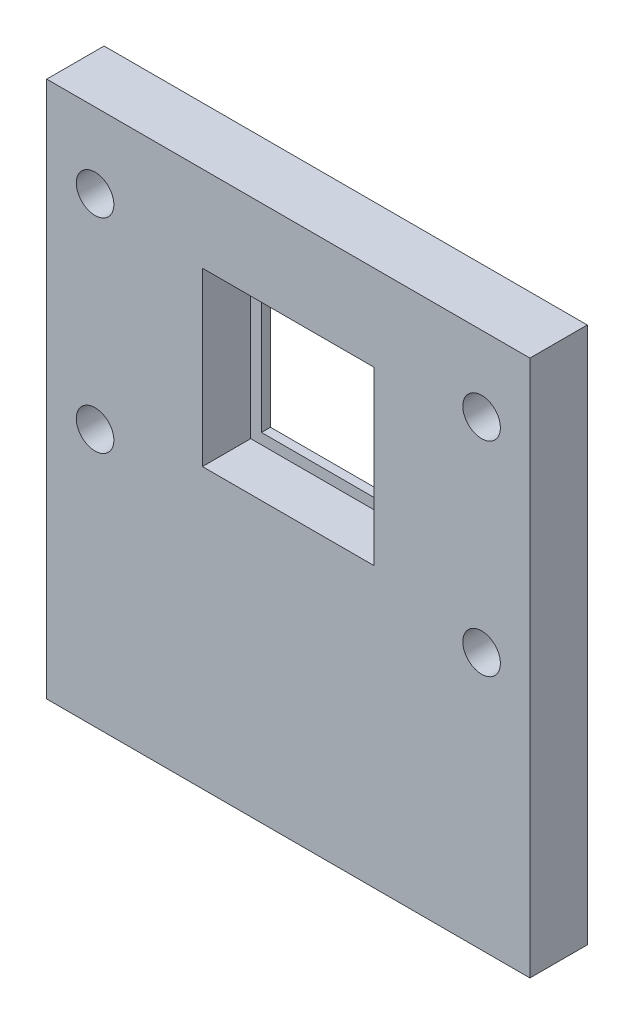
ISO-10303-21;
HEADER;
FILE_DESCRIPTION(('STEP AP214'),'2;1');
FILE_NAME('part.step','',(''),(''),'','','');
FILE_SCHEMA(('AUTOMOTIVE_DESIGN { 1 0 10303 214 1 1 1 1 }'));
ENDSEC;
DATA;
#1=APPLICATION_CONTEXT('core data for automotive mechanical design processes');
#2=APPLICATION_PROTOCOL_DEFINITION('international standard','automotive_design',2000,#1);
#3=PRODUCT_CONTEXT('',#1,'mechanical');
#4=PRODUCT('Part','Part','',(#3));
#5=PRODUCT_RELATED_PRODUCT_CATEGORY('part','',(#4));
#6=PRODUCT_DEFINITION_FORMATION('','',#4);
#7=PRODUCT_DEFINITION_CONTEXT('part definition',#1,'design');
#8=PRODUCT_DEFINITION('design','',#6,#7);
#9=PRODUCT_DEFINITION_SHAPE('','',#8);
#10=(LENGTH_UNIT() NAMED_UNIT(*) SI_UNIT(.MILLI.,.METRE.));
#11=(NAMED_UNIT(*) PLANE_ANGLE_UNIT() SI_UNIT($,.RADIAN.));
#12=(NAMED_UNIT(*) SI_UNIT($,.STERADIAN.) SOLID_ANGLE_UNIT());
#13=UNCERTAINTY_MEASURE_WITH_UNIT(LENGTH_MEASURE(1.E-05),#10,'distance_accuracy_value','');
#14=(GEOMETRIC_REPRESENTATION_CONTEXT(3) GLOBAL_UNCERTAINTY_ASSIGNED_CONTEXT((#13)) GLOBAL_UNIT_ASSIGNED_CONTEXT((#10,
#11,#12)) REPRESENTATION_CONTEXT('',''));
#15=CARTESIAN_POINT('',(0.,0.,0.));
#16=DIRECTION('',(0.,0.,1.));
#17=DIRECTION('',(1.,0.,0.));
#18=AXIS2_PLACEMENT_3D('',#15,#16,#17);
#19=CARTESIAN_POINT('',(-22.5,-25.,8.34));
#20=DIRECTION('',(1.,0.,0.));
#21=DIRECTION('',(0.,0.,-1.));
#22=AXIS2_PLACEMENT_3D('',#19,#20,#21);
#23=PLANE('',#22);
#24=DIRECTION('',(0.,1.,0.));
#25=VECTOR('',#24,1.);
#26=CARTESIAN_POINT('',(-22.5,-25.,3.));
#27=LINE('',#26,#25);
#28=CARTESIAN_POINT('',(-22.5,-25.,3.));
#29=VERTEX_POINT('',#28);
#30=CARTESIAN_POINT('',(-22.5,25.,3.));
#31=VERTEX_POINT('',#30);
#32=EDGE_CURVE('E187',#29,#31,#27,.T.);
#33=ORIENTED_EDGE('',*,*,#32,.F.);
#34=DIRECTION('',(0.,0.,-1.));
#35=VECTOR('',#34,1.);
#36=CARTESIAN_POINT('',(-22.5,-25.,8.34));
#37=LINE('',#36,#35);
#38=CARTESIAN_POINT('',(-22.5,-25.,8.34));
#39=VERTEX_POINT('',#38);
#40=EDGE_CURVE('E11',#39,#29,#37,.T.);
#41=ORIENTED_EDGE('',*,*,#40,.F.);
#42=DIRECTION('',(0.,-1.,0.));
#43=VECTOR('',#42,1.);
#44=CARTESIAN_POINT('',(-22.5,-25.,8.34));
#45=LINE('',#44,#43);
#46=CARTESIAN_POINT('',(-22.5,25.,8.34));
#47=VERTEX_POINT('',#46);
#48=EDGE_CURVE('E217',#47,#39,#45,.T.);
#49=ORIENTED_EDGE('',*,*,#48,.F.);
#50=DIRECTION('',(0.,0.,-1.));
#51=VECTOR('',#50,1.);
#52=CARTESIAN_POINT('',(-22.5,25.,8.34));
#53=LINE('',#52,#51);
#54=EDGE_CURVE('E232',#47,#31,#53,.T.);
#55=ORIENTED_EDGE('',*,*,#54,.T.);
#56=EDGE_LOOP('',(#33,#41,#49,#55));
#57=FACE_BOUND('',#56,.T.);
#58=ADVANCED_FACE('F35',(#57),#23,.F.);
#59=CARTESIAN_POINT('',(22.5,-25.,8.34));
#60=DIRECTION('',(0.,1.,0.));
#61=DIRECTION('',(-1.,0.,0.));
#62=AXIS2_PLACEMENT_3D('',#59,#60,#61);
#63=PLANE('',#62);
#64=DIRECTION('',(-1.,0.,0.));
#65=VECTOR('',#64,1.);
#66=CARTESIAN_POINT('',(-22.5,-25.,3.));
#67=LINE('',#66,#65);
#68=CARTESIAN_POINT('',(22.5,-25.,3.));
#69=VERTEX_POINT('',#68);
#70=EDGE_CURVE('E185',#69,#29,#67,.T.);
#71=ORIENTED_EDGE('',*,*,#70,.F.);
#72=DIRECTION('',(0.,0.,-1.));
#73=VECTOR('',#72,1.);
#74=CARTESIAN_POINT('',(22.5,-25.,8.34));
#75=LINE('',#74,#73);
#76=CARTESIAN_POINT('',(22.5,-25.,8.34));
#77=VERTEX_POINT('',#76);
#78=EDGE_CURVE('E42',#77,#69,#75,.T.);
#79=ORIENTED_EDGE('',*,*,#78,.F.);
#80=DIRECTION('',(1.,0.,0.));
#81=VECTOR('',#80,1.);
#82=CARTESIAN_POINT('',(22.5,-25.,8.34));
#83=LINE('',#82,#81);
#84=EDGE_CURVE('E226',#39,#77,#83,.T.);
#85=ORIENTED_EDGE('',*,*,#84,.F.);
#86=ORIENTED_EDGE('',*,*,#40,.T.);
#87=EDGE_LOOP('',(#71,#79,#85,#86));
#88=FACE_BOUND('',#87,.T.);
#89=ADVANCED_FACE('F246',(#88),#63,.F.);
#90=CARTESIAN_POINT('',(22.5,-25.,8.34));
#91=DIRECTION('',(-1.,0.,0.));
#92=DIRECTION('',(0.,0.,1.));
#93=AXIS2_PLACEMENT_3D('',#90,#91,#92);
#94=PLANE('',#93);
#95=DIRECTION('',(0.,-1.,0.));
#96=VECTOR('',#95,1.);
#97=CARTESIAN_POINT('',(22.5,-25.,3.));
#98=LINE('',#97,#96);
#99=CARTESIAN_POINT('',(22.5,25.,3.));
#100=VERTEX_POINT('',#99);
#101=EDGE_CURVE('E181',#100,#69,#98,.T.);
#102=ORIENTED_EDGE('',*,*,#101,.F.);
#103=DIRECTION('',(0.,0.,-1.));
#104=VECTOR('',#103,1.);
#105=CARTESIAN_POINT('',(22.5,25.,8.34));
#106=LINE('',#105,#104);
#107=CARTESIAN_POINT('',(22.5,25.,8.34));
#108=VERTEX_POINT('',#107);
#109=EDGE_CURVE('E235',#108,#100,#106,.T.);
#110=ORIENTED_EDGE('',*,*,#109,.F.);
#111=DIRECTION('',(0.,1.,0.));
#112=VECTOR('',#111,1.);
#113=CARTESIAN_POINT('',(22.5,-25.,8.34));
#114=LINE('',#113,#112);
#115=EDGE_CURVE('E228',#77,#108,#114,.T.);
#116=ORIENTED_EDGE('',*,*,#115,.F.);
#117=ORIENTED_EDGE('',*,*,#78,.T.);
#118=EDGE_LOOP('',(#102,#110,#116,#117));
#119=FACE_BOUND('',#118,.T.);
#120=ADVANCED_FACE('F242',(#119),#94,.F.);
#121=CARTESIAN_POINT('',(22.5,25.,8.34));
#122=DIRECTION('',(0.,-1.,0.));
#123=DIRECTION('',(1.,0.,0.));
#124=AXIS2_PLACEMENT_3D('',#121,#122,#123);
#125=PLANE('',#124);
#126=DIRECTION('',(1.,0.,0.));
#127=VECTOR('',#126,1.);
#128=CARTESIAN_POINT('',(-22.5,25.,3.));
#129=LINE('',#128,#127);
#130=EDGE_CURVE('E189',#31,#100,#129,.T.);
#131=ORIENTED_EDGE('',*,*,#130,.F.);
#132=ORIENTED_EDGE('',*,*,#54,.F.);
#133=DIRECTION('',(-1.,0.,0.));
#134=VECTOR('',#133,1.);
#135=CARTESIAN_POINT('',(22.5,25.,8.34));
#136=LINE('',#135,#134);
#137=EDGE_CURVE('E230',#108,#47,#136,.T.);
#138=ORIENTED_EDGE('',*,*,#137,.F.);
#139=ORIENTED_EDGE('',*,*,#109,.T.);
#140=EDGE_LOOP('',(#131,#132,#138,#139));
#141=FACE_BOUND('',#140,.T.);
#142=ADVANCED_FACE('F256',(#141),#125,.F.);
#143=CARTESIAN_POINT('',(0.,0.,8.34));
#144=DIRECTION('',(0.,0.,1.));
#145=DIRECTION('',(1.,0.,0.));
#146=AXIS2_PLACEMENT_3D('',#143,#144,#145);
#147=PLANE('',#146);
#148=CARTESIAN_POINT('',(18.,-1.,8.34));
#149=DIRECTION('',(0.,0.,1.));
#150=DIRECTION('',(1.,0.,0.));
#151=AXIS2_PLACEMENT_3D('',#148,#149,#150);
#152=CIRCLE('',#151,1.75);
#153=CARTESIAN_POINT('',(16.25,-1.,8.34));
#154=VERTEX_POINT('',#153);
#155=EDGE_CURVE('E156',#154,#154,#152,.F.);
#156=ORIENTED_EDGE('',*,*,#155,.T.);
#157=EDGE_LOOP('',(#156));
#158=FACE_BOUND('',#157,.T.);
#159=CARTESIAN_POINT('',(-18.,-1.,8.34));
#160=DIRECTION('',(0.,0.,1.));
#161=DIRECTION('',(1.,0.,0.));
#162=AXIS2_PLACEMENT_3D('',#159,#160,#161);
#163=CIRCLE('',#162,1.75);
#164=CARTESIAN_POINT('',(-19.75,-1.,8.34));
#165=VERTEX_POINT('',#164);
#166=EDGE_CURVE('E163',#165,#165,#163,.F.);
#167=ORIENTED_EDGE('',*,*,#166,.T.);
#168=EDGE_LOOP('',(#167));
#169=FACE_BOUND('',#168,.T.);
#170=CARTESIAN_POINT('',(-18.,18.,8.34));
#171=DIRECTION('',(0.,0.,1.));
#172=DIRECTION('',(1.,0.,0.));
#173=AXIS2_PLACEMENT_3D('',#170,#171,#172);
#174=CIRCLE('',#173,1.75);
#175=CARTESIAN_POINT('',(-19.75,18.,8.34));
#176=VERTEX_POINT('',#175);
#177=EDGE_CURVE('E169',#176,#176,#174,.F.);
#178=ORIENTED_EDGE('',*,*,#177,.T.);
#179=EDGE_LOOP('',(#178));
#180=FACE_BOUND('',#179,.T.);
#181=CARTESIAN_POINT('',(18.,18.,8.34));
#182=DIRECTION('',(0.,0.,1.));
#183=DIRECTION('',(1.,0.,0.));
#184=AXIS2_PLACEMENT_3D('',#181,#182,#183);
#185=CIRCLE('',#184,1.75);
#186=CARTESIAN_POINT('',(16.25,18.,8.34));
#187=VERTEX_POINT('',#186);
#188=EDGE_CURVE('E175',#187,#187,#185,.F.);
#189=ORIENTED_EDGE('',*,*,#188,.T.);
#190=EDGE_LOOP('',(#189));
#191=FACE_BOUND('',#190,.T.);
#192=DIRECTION('',(0.,1.,0.));
#193=VECTOR('',#192,1.);
#194=CARTESIAN_POINT('',(8.,1.,8.34));
#195=LINE('',#194,#193);
#196=CARTESIAN_POINT('',(8.,1.,8.34));
#197=VERTEX_POINT('',#196);
#198=CARTESIAN_POINT('',(8.,17.,8.34));
#199=VERTEX_POINT('',#198);
#200=EDGE_CURVE('E191',#197,#199,#195,.T.);
#201=ORIENTED_EDGE('',*,*,#200,.F.);
#202=DIRECTION('',(1.,0.,0.));
#203=VECTOR('',#202,1.);
#204=CARTESIAN_POINT('',(-8.,1.,8.34));
#205=LINE('',#204,#203);
#206=CARTESIAN_POINT('',(-8.,1.,8.34));
#207=VERTEX_POINT('',#206);
#208=EDGE_CURVE('E196',#207,#197,#205,.T.);
#209=ORIENTED_EDGE('',*,*,#208,.F.);
#210=DIRECTION('',(0.,-1.,0.));
#211=VECTOR('',#210,1.);
#212=CARTESIAN_POINT('',(-8.,1.,8.34));
#213=LINE('',#212,#211);
#214=CARTESIAN_POINT('',(-8.,17.,8.34));
#215=VERTEX_POINT('',#214);
#216=EDGE_CURVE('E210',#215,#207,#213,.T.);
#217=ORIENTED_EDGE('',*,*,#216,.F.);
#218=DIRECTION('',(-1.,0.,0.));
#219=VECTOR('',#218,1.);
#220=CARTESIAN_POINT('',(-8.,17.,8.34));
#221=LINE('',#220,#219);
#222=EDGE_CURVE('E207',#199,#215,#221,.T.);
#223=ORIENTED_EDGE('',*,*,#222,.F.);
#224=EDGE_LOOP('',(#201,#209,#217,#223));
#225=FACE_BOUND('',#224,.T.);
#226=ORIENTED_EDGE('',*,*,#48,.T.);
#227=ORIENTED_EDGE('',*,*,#84,.T.);
#228=ORIENTED_EDGE('',*,*,#115,.T.);
#229=ORIENTED_EDGE('',*,*,#137,.T.);
#230=EDGE_LOOP('',(#226,#227,#228,#229));
#231=FACE_BOUND('',#230,.T.);
#232=ADVANCED_FACE('F258',(#158,#169,#180,#191,#225,#231),#147,.T.);
#233=CARTESIAN_POINT('',(8.,1.,3.84));
#234=DIRECTION('',(1.,0.,0.));
#235=DIRECTION('',(0.,0.,-1.));
#236=AXIS2_PLACEMENT_3D('',#233,#234,#235);
#237=PLANE('',#236);
#238=ORIENTED_EDGE('',*,*,#200,.T.);
#239=DIRECTION('',(0.,0.,1.));
#240=VECTOR('',#239,1.);
#241=CARTESIAN_POINT('',(8.,17.,3.84));
#242=LINE('',#241,#240);
#243=CARTESIAN_POINT('',(8.,17.,3.84));
#244=VERTEX_POINT('',#243);
#245=EDGE_CURVE('E205',#244,#199,#242,.T.);
#246=ORIENTED_EDGE('',*,*,#245,.F.);
#247=DIRECTION('',(0.,1.,0.));
#248=VECTOR('',#247,1.);
#249=CARTESIAN_POINT('',(8.,1.,3.84));
#250=LINE('',#249,#248);
#251=CARTESIAN_POINT('',(8.,1.,3.84));
#252=VERTEX_POINT('',#251);
#253=EDGE_CURVE('E192',#252,#244,#250,.T.);
#254=ORIENTED_EDGE('',*,*,#253,.F.);
#255=DIRECTION('',(0.,0.,1.));
#256=VECTOR('',#255,1.);
#257=CARTESIAN_POINT('',(8.,1.,3.84));
#258=LINE('',#257,#256);
#259=EDGE_CURVE('E215',#252,#197,#258,.T.);
#260=ORIENTED_EDGE('',*,*,#259,.T.);
#261=EDGE_LOOP('',(#238,#246,#254,#260));
#262=FACE_BOUND('',#261,.T.);
#263=ADVANCED_FACE('F260',(#262),#237,.F.);
#264=CARTESIAN_POINT('',(-8.,1.,3.84));
#265=DIRECTION('',(0.,-1.,0.));
#266=DIRECTION('',(0.,0.,-1.));
#267=AXIS2_PLACEMENT_3D('',#264,#265,#266);
#268=PLANE('',#267);
#269=ORIENTED_EDGE('',*,*,#208,.T.);
#270=ORIENTED_EDGE('',*,*,#259,.F.);
#271=DIRECTION('',(1.,0.,0.));
#272=VECTOR('',#271,1.);
#273=CARTESIAN_POINT('',(-8.,1.,3.84));
#274=LINE('',#273,#272);
#275=CARTESIAN_POINT('',(-8.,1.,3.84));
#276=VERTEX_POINT('',#275);
#277=EDGE_CURVE('E202',#276,#252,#274,.T.);
#278=ORIENTED_EDGE('',*,*,#277,.F.);
#279=DIRECTION('',(0.,0.,1.));
#280=VECTOR('',#279,1.);
#281=CARTESIAN_POINT('',(-8.,1.,3.84));
#282=LINE('',#281,#280);
#283=EDGE_CURVE('E218',#276,#207,#282,.T.);
#284=ORIENTED_EDGE('',*,*,#283,.T.);
#285=EDGE_LOOP('',(#269,#270,#278,#284));
#286=FACE_BOUND('',#285,.T.);
#287=ADVANCED_FACE('F267',(#286),#268,.F.);
#288=CARTESIAN_POINT('',(-8.,1.,3.84));
#289=DIRECTION('',(-1.,0.,0.));
#290=DIRECTION('',(0.,-1.,0.));
#291=AXIS2_PLACEMENT_3D('',#288,#289,#290);
#292=PLANE('',#291);
#293=ORIENTED_EDGE('',*,*,#216,.T.);
#294=ORIENTED_EDGE('',*,*,#283,.F.);
#295=DIRECTION('',(0.,-1.,0.));
#296=VECTOR('',#295,1.);
#297=CARTESIAN_POINT('',(-8.,1.,3.84));
#298=LINE('',#297,#296);
#299=CARTESIAN_POINT('',(-8.,17.,3.84));
#300=VERTEX_POINT('',#299);
#301=EDGE_CURVE('E199',#300,#276,#298,.T.);
#302=ORIENTED_EDGE('',*,*,#301,.F.);
#303=DIRECTION('',(0.,0.,1.));
#304=VECTOR('',#303,1.);
#305=CARTESIAN_POINT('',(-8.,17.,3.84));
#306=LINE('',#305,#304);
#307=EDGE_CURVE('E220',#300,#215,#306,.T.);
#308=ORIENTED_EDGE('',*,*,#307,.T.);
#309=EDGE_LOOP('',(#293,#294,#302,#308));
#310=FACE_BOUND('',#309,.T.);
#311=ADVANCED_FACE('F395',(#310),#292,.F.);
#312=CARTESIAN_POINT('',(-8.,17.,3.84));
#313=DIRECTION('',(0.,1.,0.));
#314=DIRECTION('',(-1.,0.,0.));
#315=AXIS2_PLACEMENT_3D('',#312,#313,#314);
#316=PLANE('',#315);
#317=ORIENTED_EDGE('',*,*,#222,.T.);
#318=ORIENTED_EDGE('',*,*,#307,.F.);
#319=DIRECTION('',(-1.,0.,0.));
#320=VECTOR('',#319,1.);
#321=CARTESIAN_POINT('',(-8.,17.,3.84));
#322=LINE('',#321,#320);
#323=EDGE_CURVE('E195',#244,#300,#322,.T.);
#324=ORIENTED_EDGE('',*,*,#323,.F.);
#325=ORIENTED_EDGE('',*,*,#245,.T.);
#326=EDGE_LOOP('',(#317,#318,#324,#325));
#327=FACE_BOUND('',#326,.T.);
#328=ADVANCED_FACE('F345',(#327),#316,.F.);
#329=CARTESIAN_POINT('',(0.,0.,3.84));
#330=DIRECTION('',(0.,0.,-1.));
#331=DIRECTION('',(-1.,0.,0.));
#332=AXIS2_PLACEMENT_3D('',#329,#330,#331);
#333=PLANE('',#332);
#334=DIRECTION('',(1.,0.,0.));
#335=VECTOR('',#334,1.);
#336=CARTESIAN_POINT('',(-7.,2.,3.84));
#337=LINE('',#336,#335);
#338=CARTESIAN_POINT('',(-7.,2.,3.84));
#339=VERTEX_POINT('',#338);
#340=CARTESIAN_POINT('',(7.,2.,3.84));
#341=VERTEX_POINT('',#340);
#342=EDGE_CURVE('E150',#339,#341,#337,.T.);
#343=ORIENTED_EDGE('',*,*,#342,.F.);
#344=DIRECTION('',(0.,-1.,0.));
#345=VECTOR('',#344,1.);
#346=CARTESIAN_POINT('',(-7.,16.,3.84));
#347=LINE('',#346,#345);
#348=CARTESIAN_POINT('',(-7.,16.,3.84));
#349=VERTEX_POINT('',#348);
#350=EDGE_CURVE('E49',#349,#339,#347,.T.);
#351=ORIENTED_EDGE('',*,*,#350,.F.);
#352=DIRECTION('',(-1.,0.,0.));
#353=VECTOR('',#352,1.);
#354=CARTESIAN_POINT('',(-7.,16.,3.84));
#355=LINE('',#354,#353);
#356=CARTESIAN_POINT('',(7.,16.,3.84));
#357=VERTEX_POINT('',#356);
#358=EDGE_CURVE('E141',#357,#349,#355,.T.);
#359=ORIENTED_EDGE('',*,*,#358,.F.);
#360=DIRECTION('',(0.,1.,0.));
#361=VECTOR('',#360,1.);
#362=CARTESIAN_POINT('',(7.,16.,3.84));
#363=LINE('',#362,#361);
#364=EDGE_CURVE('E144',#341,#357,#363,.T.);
#365=ORIENTED_EDGE('',*,*,#364,.F.);
#366=EDGE_LOOP('',(#343,#351,#359,#365));
#367=FACE_BOUND('',#366,.T.);
#368=ORIENTED_EDGE('',*,*,#253,.T.);
#369=ORIENTED_EDGE('',*,*,#323,.T.);
#370=ORIENTED_EDGE('',*,*,#301,.T.);
#371=ORIENTED_EDGE('',*,*,#277,.T.);
#372=EDGE_LOOP('',(#368,#369,#370,#371));
#373=FACE_BOUND('',#372,.T.);
#374=ADVANCED_FACE('F341',(#367,#373),#333,.F.);
#375=CARTESIAN_POINT('',(0.,0.,3.));
#376=DIRECTION('',(0.,0.,-1.));
#377=DIRECTION('',(-1.,0.,0.));
#378=AXIS2_PLACEMENT_3D('',#375,#376,#377);
#379=PLANE('',#378);
#380=DIRECTION('',(0.,-1.,0.));
#381=VECTOR('',#380,1.);
#382=CARTESIAN_POINT('',(-7.,16.,3.));
#383=LINE('',#382,#381);
#384=CARTESIAN_POINT('',(-7.,16.,3.));
#385=VERTEX_POINT('',#384);
#386=CARTESIAN_POINT('',(-7.,2.,3.));
#387=VERTEX_POINT('',#386);
#388=EDGE_CURVE('E125',#385,#387,#383,.T.);
#389=ORIENTED_EDGE('',*,*,#388,.T.);
#390=DIRECTION('',(1.,0.,0.));
#391=VECTOR('',#390,1.);
#392=CARTESIAN_POINT('',(-7.,2.,3.));
#393=LINE('',#392,#391);
#394=CARTESIAN_POINT('',(7.,2.,3.));
#395=VERTEX_POINT('',#394);
#396=EDGE_CURVE('E134',#387,#395,#393,.T.);
#397=ORIENTED_EDGE('',*,*,#396,.T.);
#398=DIRECTION('',(0.,1.,0.));
#399=VECTOR('',#398,1.);
#400=CARTESIAN_POINT('',(7.,16.,3.));
#401=LINE('',#400,#399);
#402=CARTESIAN_POINT('',(7.,16.,3.));
#403=VERTEX_POINT('',#402);
#404=EDGE_CURVE('E57',#395,#403,#401,.T.);
#405=ORIENTED_EDGE('',*,*,#404,.T.);
#406=DIRECTION('',(-1.,0.,0.));
#407=VECTOR('',#406,1.);
#408=CARTESIAN_POINT('',(-7.,16.,3.));
#409=LINE('',#408,#407);
#410=EDGE_CURVE('E131',#403,#385,#409,.T.);
#411=ORIENTED_EDGE('',*,*,#410,.T.);
#412=EDGE_LOOP('',(#389,#397,#405,#411));
#413=FACE_BOUND('',#412,.T.);
#414=CARTESIAN_POINT('',(18.,-1.,3.));
#415=DIRECTION('',(0.,0.,-1.));
#416=DIRECTION('',(-1.,0.,0.));
#417=AXIS2_PLACEMENT_3D('',#414,#415,#416);
#418=CIRCLE('',#417,1.75);
#419=CARTESIAN_POINT('',(16.25,-1.,3.));
#420=VERTEX_POINT('',#419);
#421=EDGE_CURVE('E160',#420,#420,#418,.T.);
#422=ORIENTED_EDGE('',*,*,#421,.F.);
#423=EDGE_LOOP('',(#422));
#424=FACE_BOUND('',#423,.T.);
#425=CARTESIAN_POINT('',(-18.,-1.,3.));
#426=DIRECTION('',(0.,0.,-1.));
#427=DIRECTION('',(-1.,0.,0.));
#428=AXIS2_PLACEMENT_3D('',#425,#426,#427);
#429=CIRCLE('',#428,1.75);
#430=CARTESIAN_POINT('',(-19.75,-1.,3.));
#431=VERTEX_POINT('',#430);
#432=EDGE_CURVE('E166',#431,#431,#429,.T.);
#433=ORIENTED_EDGE('',*,*,#432,.F.);
#434=EDGE_LOOP('',(#433));
#435=FACE_BOUND('',#434,.T.);
#436=CARTESIAN_POINT('',(-18.,18.,3.));
#437=DIRECTION('',(0.,0.,-1.));
#438=DIRECTION('',(-1.,0.,0.));
#439=AXIS2_PLACEMENT_3D('',#436,#437,#438);
#440=CIRCLE('',#439,1.75);
#441=CARTESIAN_POINT('',(-19.75,18.,3.));
#442=VERTEX_POINT('',#441);
#443=EDGE_CURVE('E172',#442,#442,#440,.T.);
#444=ORIENTED_EDGE('',*,*,#443,.F.);
#445=EDGE_LOOP('',(#444));
#446=FACE_BOUND('',#445,.T.);
#447=CARTESIAN_POINT('',(18.,18.,3.));
#448=DIRECTION('',(0.,0.,-1.));
#449=DIRECTION('',(-1.,0.,0.));
#450=AXIS2_PLACEMENT_3D('',#447,#448,#449);
#451=CIRCLE('',#450,1.75);
#452=CARTESIAN_POINT('',(16.25,18.,3.));
#453=VERTEX_POINT('',#452);
#454=EDGE_CURVE('E178',#453,#453,#451,.T.);
#455=ORIENTED_EDGE('',*,*,#454,.F.);
#456=EDGE_LOOP('',(#455));
#457=FACE_BOUND('',#456,.T.);
#458=ORIENTED_EDGE('',*,*,#101,.T.);
#459=ORIENTED_EDGE('',*,*,#70,.T.);
#460=ORIENTED_EDGE('',*,*,#32,.T.);
#461=ORIENTED_EDGE('',*,*,#130,.T.);
#462=EDGE_LOOP('',(#458,#459,#460,#461));
#463=FACE_BOUND('',#462,.T.);
#464=ADVANCED_FACE('F138',(#413,#424,#435,#446,#457,#463),#379,.T.);
#465=CARTESIAN_POINT('',(18.,18.,8.341));
#466=DIRECTION('',(0.,0.,-1.));
#467=DIRECTION('',(-1.,0.,0.));
#468=AXIS2_PLACEMENT_3D('',#465,#466,#467);
#469=CYLINDRICAL_SURFACE('',#468,1.75);
#470=CARTESIAN_POINT('',(16.25,18.,8.34));
#471=CARTESIAN_POINT('',(16.25,18.,8.284375));
#472=CARTESIAN_POINT('',(16.25,18.,8.22875));
#473=CARTESIAN_POINT('',(16.25,18.,8.1175));
#474=CARTESIAN_POINT('',(16.25,18.,8.061875));
#475=CARTESIAN_POINT('',(16.25,18.,7.950625));
#476=CARTESIAN_POINT('',(16.25,18.,7.895));
#477=CARTESIAN_POINT('',(16.25,18.,7.78375));
#478=CARTESIAN_POINT('',(16.25,18.,7.728125));
#479=CARTESIAN_POINT('',(16.25,18.,7.616875));
#480=CARTESIAN_POINT('',(16.25,18.,7.56125));
#481=CARTESIAN_POINT('',(16.25,18.,7.45));
#482=CARTESIAN_POINT('',(16.25,18.,7.394375));
#483=CARTESIAN_POINT('',(16.25,18.,7.283125));
#484=CARTESIAN_POINT('',(16.25,18.,7.2275));
#485=CARTESIAN_POINT('',(16.25,18.,7.11625));
#486=CARTESIAN_POINT('',(16.25,18.,7.060625));
#487=CARTESIAN_POINT('',(16.25,18.,6.949375));
#488=CARTESIAN_POINT('',(16.25,18.,6.89375));
#489=CARTESIAN_POINT('',(16.25,18.,6.7825));
#490=CARTESIAN_POINT('',(16.25,18.,6.726875));
#491=CARTESIAN_POINT('',(16.25,18.,6.615625));
#492=CARTESIAN_POINT('',(16.25,18.,6.56));
#493=CARTESIAN_POINT('',(16.25,18.,6.44875));
#494=CARTESIAN_POINT('',(16.25,18.,6.393125));
#495=CARTESIAN_POINT('',(16.25,18.,6.281875));
#496=CARTESIAN_POINT('',(16.25,18.,6.22625));
#497=CARTESIAN_POINT('',(16.25,18.,6.115));
#498=CARTESIAN_POINT('',(16.25,18.,6.059375));
#499=CARTESIAN_POINT('',(16.25,18.,5.948125));
#500=CARTESIAN_POINT('',(16.25,18.,5.8925));
#501=CARTESIAN_POINT('',(16.25,18.,5.78125));
#502=CARTESIAN_POINT('',(16.25,18.,5.725625));
#503=CARTESIAN_POINT('',(16.25,18.,5.614375));
#504=CARTESIAN_POINT('',(16.25,18.,5.55875));
#505=CARTESIAN_POINT('',(16.25,18.,5.4475));
#506=CARTESIAN_POINT('',(16.25,18.,5.391875));
#507=CARTESIAN_POINT('',(16.25,18.,5.280625));
#508=CARTESIAN_POINT('',(16.25,18.,5.225));
#509=CARTESIAN_POINT('',(16.25,18.,5.11375));
#510=CARTESIAN_POINT('',(16.25,18.,5.058125));
#511=CARTESIAN_POINT('',(16.25,18.,4.946875));
#512=CARTESIAN_POINT('',(16.25,18.,4.89125));
#513=CARTESIAN_POINT('',(16.25,18.,4.78));
#514=CARTESIAN_POINT('',(16.25,18.,4.724375));
#515=CARTESIAN_POINT('',(16.25,18.,4.613125));
#516=CARTESIAN_POINT('',(16.25,18.,4.5575));
#517=CARTESIAN_POINT('',(16.25,18.,4.44625));
#518=CARTESIAN_POINT('',(16.25,18.,4.390625));
#519=CARTESIAN_POINT('',(16.25,18.,4.279375));
#520=CARTESIAN_POINT('',(16.25,18.,4.22375));
#521=CARTESIAN_POINT('',(16.25,18.,4.1125));
#522=CARTESIAN_POINT('',(16.25,18.,4.056875));
#523=CARTESIAN_POINT('',(16.25,18.,3.945625));
#524=CARTESIAN_POINT('',(16.25,18.,3.89));
#525=CARTESIAN_POINT('',(16.25,18.,3.77875));
#526=CARTESIAN_POINT('',(16.25,18.,3.723125));
#527=CARTESIAN_POINT('',(16.25,18.,3.611875));
#528=CARTESIAN_POINT('',(16.25,18.,3.55625));
#529=CARTESIAN_POINT('',(16.25,18.,3.445));
#530=CARTESIAN_POINT('',(16.25,18.,3.389375));
#531=CARTESIAN_POINT('',(16.25,18.,3.278125));
#532=CARTESIAN_POINT('',(16.25,18.,3.2225));
#533=CARTESIAN_POINT('',(16.25,18.,3.11125));
#534=CARTESIAN_POINT('',(16.25,18.,3.055625));
#535=CARTESIAN_POINT('',(16.25,18.,3.));
#536=B_SPLINE_CURVE_WITH_KNOTS('',3,(#470,#471,#472,#473,#474,#475,#476,#477,#478,#479,#480,
#481,#482,#483,#484,#485,#486,#487,#488,#489,#490,#491,#492,#493,#494,#495,#496,#497,#498,#499,
#500,#501,#502,#503,#504,#505,#506,#507,#508,#509,#510,#511,#512,#513,#514,#515,#516,#517,#518,
#519,#520,#521,#522,#523,#524,#525,#526,#527,#528,#529,#530,#531,#532,#533,#534,#535),
.UNSPECIFIED.,.F.,.F.,(4,2,2,2,2,2,2,2,2,2,2,2,2,2,2,2,2,2,2,2,2,2,2,2,2,2,2,2,2,2,2,2,4),(0.,
0.166874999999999,0.333749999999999,0.500624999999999,0.667499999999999,0.834374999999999,
1.00125,1.168125,1.335,1.501875,1.66875,1.835625,2.0025,2.169375,2.33625,2.503125,2.67,2.836875,
3.00375,3.170625,3.3375,3.504375,3.67125,3.838125,4.005,4.171875,4.33875,4.505625,4.6725,
4.839375,5.00625,5.173125,5.34),.UNSPECIFIED.);
#537=EDGE_CURVE('BSEAM297',#187,#453,#536,.T.);
#538=ORIENTED_EDGE('',*,*,#188,.F.);
#539=ORIENTED_EDGE('',*,*,#454,.T.);
#540=ORIENTED_EDGE('',*,*,#537,.T.);
#541=ORIENTED_EDGE('',*,*,#537,.F.);
#542=EDGE_LOOP('',(#538,#540,#539,#541));
#543=FACE_BOUND('',#542,.T.);
#544=ADVANCED_FACE('F297',(#543),#469,.F.);
#545=CARTESIAN_POINT('',(-18.,18.,8.341));
#546=DIRECTION('',(0.,0.,-1.));
#547=DIRECTION('',(-1.,0.,0.));
#548=AXIS2_PLACEMENT_3D('',#545,#546,#547);
#549=CYLINDRICAL_SURFACE('',#548,1.75);
#550=CARTESIAN_POINT('',(-19.75,18.,8.34));
#551=CARTESIAN_POINT('',(-19.75,18.,8.284375));
#552=CARTESIAN_POINT('',(-19.75,18.,8.22875));
#553=CARTESIAN_POINT('',(-19.75,18.,8.1175));
#554=CARTESIAN_POINT('',(-19.75,18.,8.061875));
#555=CARTESIAN_POINT('',(-19.75,18.,7.950625));
#556=CARTESIAN_POINT('',(-19.75,18.,7.895));
#557=CARTESIAN_POINT('',(-19.75,18.,7.78375));
#558=CARTESIAN_POINT('',(-19.75,18.,7.728125));
#559=CARTESIAN_POINT('',(-19.75,18.,7.616875));
#560=CARTESIAN_POINT('',(-19.75,18.,7.56125));
#561=CARTESIAN_POINT('',(-19.75,18.,7.45));
#562=CARTESIAN_POINT('',(-19.75,18.,7.394375));
#563=CARTESIAN_POINT('',(-19.75,18.,7.283125));
#564=CARTESIAN_POINT('',(-19.75,18.,7.2275));
#565=CARTESIAN_POINT('',(-19.75,18.,7.11625));
#566=CARTESIAN_POINT('',(-19.75,18.,7.060625));
#567=CARTESIAN_POINT('',(-19.75,18.,6.949375));
#568=CARTESIAN_POINT('',(-19.75,18.,6.89375));
#569=CARTESIAN_POINT('',(-19.75,18.,6.7825));
#570=CARTESIAN_POINT('',(-19.75,18.,6.726875));
#571=CARTESIAN_POINT('',(-19.75,18.,6.615625));
#572=CARTESIAN_POINT('',(-19.75,18.,6.56));
#573=CARTESIAN_POINT('',(-19.75,18.,6.44875));
#574=CARTESIAN_POINT('',(-19.75,18.,6.393125));
#575=CARTESIAN_POINT('',(-19.75,18.,6.281875));
#576=CARTESIAN_POINT('',(-19.75,18.,6.22625));
#577=CARTESIAN_POINT('',(-19.75,18.,6.115));
#578=CARTESIAN_POINT('',(-19.75,18.,6.059375));
#579=CARTESIAN_POINT('',(-19.75,18.,5.948125));
#580=CARTESIAN_POINT('',(-19.75,18.,5.8925));
#581=CARTESIAN_POINT('',(-19.75,18.,5.78125));
#582=CARTESIAN_POINT('',(-19.75,18.,5.725625));
#583=CARTESIAN_POINT('',(-19.75,18.,5.614375));
#584=CARTESIAN_POINT('',(-19.75,18.,5.55875));
#585=CARTESIAN_POINT('',(-19.75,18.,5.4475));
#586=CARTESIAN_POINT('',(-19.75,18.,5.391875));
#587=CARTESIAN_POINT('',(-19.75,18.,5.280625));
#588=CARTESIAN_POINT('',(-19.75,18.,5.225));
#589=CARTESIAN_POINT('',(-19.75,18.,5.11375));
#590=CARTESIAN_POINT('',(-19.75,18.,5.058125));
#591=CARTESIAN_POINT('',(-19.75,18.,4.946875));
#592=CARTESIAN_POINT('',(-19.75,18.,4.89125));
#593=CARTESIAN_POINT('',(-19.75,18.,4.78));
#594=CARTESIAN_POINT('',(-19.75,18.,4.724375));
#595=CARTESIAN_POINT('',(-19.75,18.,4.613125));
#596=CARTESIAN_POINT('',(-19.75,18.,4.5575));
#597=CARTESIAN_POINT('',(-19.75,18.,4.44625));
#598=CARTESIAN_POINT('',(-19.75,18.,4.390625));
#599=CARTESIAN_POINT('',(-19.75,18.,4.279375));
#600=CARTESIAN_POINT('',(-19.75,18.,4.22375));
#601=CARTESIAN_POINT('',(-19.75,18.,4.1125));
#602=CARTESIAN_POINT('',(-19.75,18.,4.056875));
#603=CARTESIAN_POINT('',(-19.75,18.,3.945625));
#604=CARTESIAN_POINT('',(-19.75,18.,3.89));
#605=CARTESIAN_POINT('',(-19.75,18.,3.77875));
#606=CARTESIAN_POINT('',(-19.75,18.,3.723125));
#607=CARTESIAN_POINT('',(-19.75,18.,3.611875));
#608=CARTESIAN_POINT('',(-19.75,18.,3.55625));
#609=CARTESIAN_POINT('',(-19.75,18.,3.445));
#610=CARTESIAN_POINT('',(-19.75,18.,3.389375));
#611=CARTESIAN_POINT('',(-19.75,18.,3.278125));
#612=CARTESIAN_POINT('',(-19.75,18.,3.2225));
#613=CARTESIAN_POINT('',(-19.75,18.,3.11125));
#614=CARTESIAN_POINT('',(-19.75,18.,3.055625));
#615=CARTESIAN_POINT('',(-19.75,18.,3.));
#616=B_SPLINE_CURVE_WITH_KNOTS('',3,(#550,#551,#552,#553,#554,#555,#556,#557,#558,#559,#560,
#561,#562,#563,#564,#565,#566,#567,#568,#569,#570,#571,#572,#573,#574,#575,#576,#577,#578,#579,
#580,#581,#582,#583,#584,#585,#586,#587,#588,#589,#590,#591,#592,#593,#594,#595,#596,#597,#598,
#599,#600,#601,#602,#603,#604,#605,#606,#607,#608,#609,#610,#611,#612,#613,#614,#615),
.UNSPECIFIED.,.F.,.F.,(4,2,2,2,2,2,2,2,2,2,2,2,2,2,2,2,2,2,2,2,2,2,2,2,2,2,2,2,2,2,2,2,4),(0.,
0.166874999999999,0.333749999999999,0.500624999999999,0.667499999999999,0.834374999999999,
1.00125,1.168125,1.335,1.501875,1.66875,1.835625,2.0025,2.169375,2.33625,2.503125,2.67,2.836875,
3.00375,3.170625,3.3375,3.504375,3.67125,3.838125,4.005,4.171875,4.33875,4.505625,4.6725,
4.839375,5.00625,5.173125,5.34),.UNSPECIFIED.);
#617=EDGE_CURVE('BSEAM302',#176,#442,#616,.T.);
#618=ORIENTED_EDGE('',*,*,#177,.F.);
#619=ORIENTED_EDGE('',*,*,#443,.T.);
#620=ORIENTED_EDGE('',*,*,#617,.T.);
#621=ORIENTED_EDGE('',*,*,#617,.F.);
#622=EDGE_LOOP('',(#618,#620,#619,#621));
#623=FACE_BOUND('',#622,.T.);
#624=ADVANCED_FACE('F302',(#623),#549,.F.);
#625=CARTESIAN_POINT('',(-18.,-1.,8.341));
#626=DIRECTION('',(0.,0.,-1.));
#627=DIRECTION('',(-1.,0.,0.));
#628=AXIS2_PLACEMENT_3D('',#625,#626,#627);
#629=CYLINDRICAL_SURFACE('',#628,1.75);
#630=CARTESIAN_POINT('',(-19.75,-1.,8.34));
#631=CARTESIAN_POINT('',(-19.75,-1.,8.284375));
#632=CARTESIAN_POINT('',(-19.75,-1.,8.22875));
#633=CARTESIAN_POINT('',(-19.75,-1.,8.1175));
#634=CARTESIAN_POINT('',(-19.75,-1.,8.061875));
#635=CARTESIAN_POINT('',(-19.75,-1.,7.950625));
#636=CARTESIAN_POINT('',(-19.75,-1.,7.895));
#637=CARTESIAN_POINT('',(-19.75,-1.,7.78375));
#638=CARTESIAN_POINT('',(-19.75,-1.,7.728125));
#639=CARTESIAN_POINT('',(-19.75,-1.,7.616875));
#640=CARTESIAN_POINT('',(-19.75,-1.,7.56125));
#641=CARTESIAN_POINT('',(-19.75,-1.,7.45));
#642=CARTESIAN_POINT('',(-19.75,-1.,7.394375));
#643=CARTESIAN_POINT('',(-19.75,-1.,7.283125));
#644=CARTESIAN_POINT('',(-19.75,-1.,7.2275));
#645=CARTESIAN_POINT('',(-19.75,-1.,7.11625));
#646=CARTESIAN_POINT('',(-19.75,-1.,7.060625));
#647=CARTESIAN_POINT('',(-19.75,-1.,6.949375));
#648=CARTESIAN_POINT('',(-19.75,-1.,6.89375));
#649=CARTESIAN_POINT('',(-19.75,-1.,6.7825));
#650=CARTESIAN_POINT('',(-19.75,-1.,6.726875));
#651=CARTESIAN_POINT('',(-19.75,-1.,6.615625));
#652=CARTESIAN_POINT('',(-19.75,-1.,6.56));
#653=CARTESIAN_POINT('',(-19.75,-1.,6.44875));
#654=CARTESIAN_POINT('',(-19.75,-1.,6.393125));
#655=CARTESIAN_POINT('',(-19.75,-1.,6.281875));
#656=CARTESIAN_POINT('',(-19.75,-1.,6.22625));
#657=CARTESIAN_POINT('',(-19.75,-1.,6.115));
#658=CARTESIAN_POINT('',(-19.75,-1.,6.059375));
#659=CARTESIAN_POINT('',(-19.75,-1.,5.948125));
#660=CARTESIAN_POINT('',(-19.75,-1.,5.8925));
#661=CARTESIAN_POINT('',(-19.75,-1.,5.78125));
#662=CARTESIAN_POINT('',(-19.75,-1.,5.725625));
#663=CARTESIAN_POINT('',(-19.75,-1.,5.614375));
#664=CARTESIAN_POINT('',(-19.75,-1.,5.55875));
#665=CARTESIAN_POINT('',(-19.75,-1.,5.4475));
#666=CARTESIAN_POINT('',(-19.75,-1.,5.391875));
#667=CARTESIAN_POINT('',(-19.75,-1.,5.280625));
#668=CARTESIAN_POINT('',(-19.75,-1.,5.225));
#669=CARTESIAN_POINT('',(-19.75,-1.,5.11375));
#670=CARTESIAN_POINT('',(-19.75,-1.,5.058125));
#671=CARTESIAN_POINT('',(-19.75,-1.,4.946875));
#672=CARTESIAN_POINT('',(-19.75,-1.,4.89125));
#673=CARTESIAN_POINT('',(-19.75,-1.,4.78));
#674=CARTESIAN_POINT('',(-19.75,-1.,4.724375));
#675=CARTESIAN_POINT('',(-19.75,-1.,4.613125));
#676=CARTESIAN_POINT('',(-19.75,-1.,4.5575));
#677=CARTESIAN_POINT('',(-19.75,-1.,4.44625));
#678=CARTESIAN_POINT('',(-19.75,-1.,4.390625));
#679=CARTESIAN_POINT('',(-19.75,-1.,4.279375));
#680=CARTESIAN_POINT('',(-19.75,-1.,4.22375));
#681=CARTESIAN_POINT('',(-19.75,-1.,4.1125));
#682=CARTESIAN_POINT('',(-19.75,-1.,4.056875));
#683=CARTESIAN_POINT('',(-19.75,-1.,3.945625));
#684=CARTESIAN_POINT('',(-19.75,-1.,3.89));
#685=CARTESIAN_POINT('',(-19.75,-1.,3.77875));
#686=CARTESIAN_POINT('',(-19.75,-1.,3.723125));
#687=CARTESIAN_POINT('',(-19.75,-1.,3.611875));
#688=CARTESIAN_POINT('',(-19.75,-1.,3.55625));
#689=CARTESIAN_POINT('',(-19.75,-1.,3.445));
#690=CARTESIAN_POINT('',(-19.75,-1.,3.389375));
#691=CARTESIAN_POINT('',(-19.75,-1.,3.278125));
#692=CARTESIAN_POINT('',(-19.75,-1.,3.2225));
#693=CARTESIAN_POINT('',(-19.75,-1.,3.11125));
#694=CARTESIAN_POINT('',(-19.75,-1.,3.055625));
#695=CARTESIAN_POINT('',(-19.75,-1.,3.));
#696=B_SPLINE_CURVE_WITH_KNOTS('',3,(#630,#631,#632,#633,#634,#635,#636,#637,#638,#639,#640,
#641,#642,#643,#644,#645,#646,#647,#648,#649,#650,#651,#652,#653,#654,#655,#656,#657,#658,#659,
#660,#661,#662,#663,#664,#665,#666,#667,#668,#669,#670,#671,#672,#673,#674,#675,#676,#677,#678,
#679,#680,#681,#682,#683,#684,#685,#686,#687,#688,#689,#690,#691,#692,#693,#694,#695),
.UNSPECIFIED.,.F.,.F.,(4,2,2,2,2,2,2,2,2,2,2,2,2,2,2,2,2,2,2,2,2,2,2,2,2,2,2,2,2,2,2,2,4),(0.,
0.166874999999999,0.333749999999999,0.500624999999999,0.667499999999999,0.834374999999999,
1.00125,1.168125,1.335,1.501875,1.66875,1.835625,2.0025,2.169375,2.33625,2.503125,2.67,2.836875,
3.00375,3.170625,3.3375,3.504375,3.67125,3.838125,4.005,4.171875,4.33875,4.505625,4.6725,
4.839375,5.00625,5.173125,5.34),.UNSPECIFIED.);
#697=EDGE_CURVE('BSEAM314',#165,#431,#696,.T.);
#698=ORIENTED_EDGE('',*,*,#166,.F.);
#699=ORIENTED_EDGE('',*,*,#432,.T.);
#700=ORIENTED_EDGE('',*,*,#697,.T.);
#701=ORIENTED_EDGE('',*,*,#697,.F.);
#702=EDGE_LOOP('',(#698,#700,#699,#701));
#703=FACE_BOUND('',#702,.T.);
#704=ADVANCED_FACE('F314',(#703),#629,.F.);
#705=CARTESIAN_POINT('',(18.,-1.,8.341));
#706=DIRECTION('',(0.,0.,-1.));
#707=DIRECTION('',(-1.,0.,0.));
#708=AXIS2_PLACEMENT_3D('',#705,#706,#707);
#709=CYLINDRICAL_SURFACE('',#708,1.75);
#710=CARTESIAN_POINT('',(16.25,-1.,8.34));
#711=CARTESIAN_POINT('',(16.25,-1.,8.284375));
#712=CARTESIAN_POINT('',(16.25,-1.,8.22875));
#713=CARTESIAN_POINT('',(16.25,-1.,8.1175));
#714=CARTESIAN_POINT('',(16.25,-1.,8.061875));
#715=CARTESIAN_POINT('',(16.25,-1.,7.950625));
#716=CARTESIAN_POINT('',(16.25,-1.,7.895));
#717=CARTESIAN_POINT('',(16.25,-1.,7.78375));
#718=CARTESIAN_POINT('',(16.25,-1.,7.728125));
#719=CARTESIAN_POINT('',(16.25,-1.,7.616875));
#720=CARTESIAN_POINT('',(16.25,-1.,7.56125));
#721=CARTESIAN_POINT('',(16.25,-1.,7.45));
#722=CARTESIAN_POINT('',(16.25,-1.,7.394375));
#723=CARTESIAN_POINT('',(16.25,-1.,7.283125));
#724=CARTESIAN_POINT('',(16.25,-1.,7.2275));
#725=CARTESIAN_POINT('',(16.25,-1.,7.11625));
#726=CARTESIAN_POINT('',(16.25,-1.,7.060625));
#727=CARTESIAN_POINT('',(16.25,-1.,6.949375));
#728=CARTESIAN_POINT('',(16.25,-1.,6.89375));
#729=CARTESIAN_POINT('',(16.25,-1.,6.7825));
#730=CARTESIAN_POINT('',(16.25,-1.,6.726875));
#731=CARTESIAN_POINT('',(16.25,-1.,6.615625));
#732=CARTESIAN_POINT('',(16.25,-1.,6.56));
#733=CARTESIAN_POINT('',(16.25,-1.,6.44875));
#734=CARTESIAN_POINT('',(16.25,-1.,6.393125));
#735=CARTESIAN_POINT('',(16.25,-1.,6.281875));
#736=CARTESIAN_POINT('',(16.25,-1.,6.22625));
#737=CARTESIAN_POINT('',(16.25,-1.,6.115));
#738=CARTESIAN_POINT('',(16.25,-1.,6.059375));
#739=CARTESIAN_POINT('',(16.25,-1.,5.948125));
#740=CARTESIAN_POINT('',(16.25,-1.,5.8925));
#741=CARTESIAN_POINT('',(16.25,-1.,5.78125));
#742=CARTESIAN_POINT('',(16.25,-1.,5.725625));
#743=CARTESIAN_POINT('',(16.25,-1.,5.614375));
#744=CARTESIAN_POINT('',(16.25,-1.,5.55875));
#745=CARTESIAN_POINT('',(16.25,-1.,5.4475));
#746=CARTESIAN_POINT('',(16.25,-1.,5.391875));
#747=CARTESIAN_POINT('',(16.25,-1.,5.280625));
#748=CARTESIAN_POINT('',(16.25,-1.,5.225));
#749=CARTESIAN_POINT('',(16.25,-1.,5.11375));
#750=CARTESIAN_POINT('',(16.25,-1.,5.058125));
#751=CARTESIAN_POINT('',(16.25,-1.,4.946875));
#752=CARTESIAN_POINT('',(16.25,-1.,4.89125));
#753=CARTESIAN_POINT('',(16.25,-1.,4.78));
#754=CARTESIAN_POINT('',(16.25,-1.,4.724375));
#755=CARTESIAN_POINT('',(16.25,-1.,4.613125));
#756=CARTESIAN_POINT('',(16.25,-1.,4.5575));
#757=CARTESIAN_POINT('',(16.25,-1.,4.44625));
#758=CARTESIAN_POINT('',(16.25,-1.,4.390625));
#759=CARTESIAN_POINT('',(16.25,-1.,4.279375));
#760=CARTESIAN_POINT('',(16.25,-1.,4.22375));
#761=CARTESIAN_POINT('',(16.25,-1.,4.1125));
#762=CARTESIAN_POINT('',(16.25,-1.,4.056875));
#763=CARTESIAN_POINT('',(16.25,-1.,3.945625));
#764=CARTESIAN_POINT('',(16.25,-1.,3.89));
#765=CARTESIAN_POINT('',(16.25,-1.,3.77875));
#766=CARTESIAN_POINT('',(16.25,-1.,3.723125));
#767=CARTESIAN_POINT('',(16.25,-1.,3.611875));
#768=CARTESIAN_POINT('',(16.25,-1.,3.55625));
#769=CARTESIAN_POINT('',(16.25,-1.,3.445));
#770=CARTESIAN_POINT('',(16.25,-1.,3.389375));
#771=CARTESIAN_POINT('',(16.25,-1.,3.278125));
#772=CARTESIAN_POINT('',(16.25,-1.,3.2225));
#773=CARTESIAN_POINT('',(16.25,-1.,3.11125));
#774=CARTESIAN_POINT('',(16.25,-1.,3.055625));
#775=CARTESIAN_POINT('',(16.25,-1.,3.));
#776=B_SPLINE_CURVE_WITH_KNOTS('',3,(#710,#711,#712,#713,#714,#715,#716,#717,#718,#719,#720,
#721,#722,#723,#724,#725,#726,#727,#728,#729,#730,#731,#732,#733,#734,#735,#736,#737,#738,#739,
#740,#741,#742,#743,#744,#745,#746,#747,#748,#749,#750,#751,#752,#753,#754,#755,#756,#757,#758,
#759,#760,#761,#762,#763,#764,#765,#766,#767,#768,#769,#770,#771,#772,#773,#774,#775),
.UNSPECIFIED.,.F.,.F.,(4,2,2,2,2,2,2,2,2,2,2,2,2,2,2,2,2,2,2,2,2,2,2,2,2,2,2,2,2,2,2,2,4),(0.,
0.166874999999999,0.333749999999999,0.500624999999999,0.667499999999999,0.834374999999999,
1.00125,1.168125,1.335,1.501875,1.66875,1.835625,2.0025,2.169375,2.33625,2.503125,2.67,2.836875,
3.00375,3.170625,3.3375,3.504375,3.67125,3.838125,4.005,4.171875,4.33875,4.505625,4.6725,
4.839375,5.00625,5.173125,5.34),.UNSPECIFIED.);
#777=EDGE_CURVE('BSEAM324',#154,#420,#776,.T.);
#778=ORIENTED_EDGE('',*,*,#155,.F.);
#779=ORIENTED_EDGE('',*,*,#421,.T.);
#780=ORIENTED_EDGE('',*,*,#777,.T.);
#781=ORIENTED_EDGE('',*,*,#777,.F.);
#782=EDGE_LOOP('',(#778,#780,#779,#781));
#783=FACE_BOUND('',#782,.T.);
#784=ADVANCED_FACE('F324',(#783),#709,.F.);
#785=CARTESIAN_POINT('',(-7.,16.,3.));
#786=DIRECTION('',(-1.,0.,0.));
#787=DIRECTION('',(0.,-1.,0.));
#788=AXIS2_PLACEMENT_3D('',#785,#786,#787);
#789=PLANE('',#788);
#790=ORIENTED_EDGE('',*,*,#350,.T.);
#791=DIRECTION('',(0.,0.,1.));
#792=VECTOR('',#791,1.);
#793=CARTESIAN_POINT('',(-7.,2.,3.));
#794=LINE('',#793,#792);
#795=EDGE_CURVE('E121',#387,#339,#794,.T.);
#796=ORIENTED_EDGE('',*,*,#795,.F.);
#797=ORIENTED_EDGE('',*,*,#388,.F.);
#798=DIRECTION('',(0.,0.,1.));
#799=VECTOR('',#798,1.);
#800=CARTESIAN_POINT('',(-7.,16.,3.));
#801=LINE('',#800,#799);
#802=EDGE_CURVE('E154',#385,#349,#801,.T.);
#803=ORIENTED_EDGE('',*,*,#802,.T.);
#804=EDGE_LOOP('',(#790,#796,#797,#803));
#805=FACE_BOUND('',#804,.T.);
#806=ADVANCED_FACE('F123',(#805),#789,.F.);
#807=CARTESIAN_POINT('',(-7.,16.,3.));
#808=DIRECTION('',(0.,1.,0.));
#809=DIRECTION('',(0.,0.,1.));
#810=AXIS2_PLACEMENT_3D('',#807,#808,#809);
#811=PLANE('',#810);
#812=ORIENTED_EDGE('',*,*,#358,.T.);
#813=ORIENTED_EDGE('',*,*,#802,.F.);
#814=ORIENTED_EDGE('',*,*,#410,.F.);
#815=DIRECTION('',(0.,0.,1.));
#816=VECTOR('',#815,1.);
#817=CARTESIAN_POINT('',(7.,16.,3.));
#818=LINE('',#817,#816);
#819=EDGE_CURVE('E157',#403,#357,#818,.T.);
#820=ORIENTED_EDGE('',*,*,#819,.T.);
#821=EDGE_LOOP('',(#812,#813,#814,#820));
#822=FACE_BOUND('',#821,.T.);
#823=ADVANCED_FACE('F362',(#822),#811,.F.);
#824=CARTESIAN_POINT('',(7.,16.,3.));
#825=DIRECTION('',(1.,0.,0.));
#826=DIRECTION('',(0.,1.,0.));
#827=AXIS2_PLACEMENT_3D('',#824,#825,#826);
#828=PLANE('',#827);
#829=ORIENTED_EDGE('',*,*,#364,.T.);
#830=ORIENTED_EDGE('',*,*,#819,.F.);
#831=ORIENTED_EDGE('',*,*,#404,.F.);
#832=DIRECTION('',(0.,0.,1.));
#833=VECTOR('',#832,1.);
#834=CARTESIAN_POINT('',(7.,2.,3.));
#835=LINE('',#834,#833);
#836=EDGE_CURVE('E130',#395,#341,#835,.T.);
#837=ORIENTED_EDGE('',*,*,#836,.T.);
#838=EDGE_LOOP('',(#829,#830,#831,#837));
#839=FACE_BOUND('',#838,.T.);
#840=ADVANCED_FACE('F371',(#839),#828,.F.);
#841=CARTESIAN_POINT('',(-7.,2.,3.));
#842=DIRECTION('',(0.,-1.,0.));
#843=DIRECTION('',(1.,0.,0.));
#844=AXIS2_PLACEMENT_3D('',#841,#842,#843);
#845=PLANE('',#844);
#846=ORIENTED_EDGE('',*,*,#342,.T.);
#847=ORIENTED_EDGE('',*,*,#836,.F.);
#848=ORIENTED_EDGE('',*,*,#396,.F.);
#849=ORIENTED_EDGE('',*,*,#795,.T.);
#850=EDGE_LOOP('',(#846,#847,#848,#849));
#851=FACE_BOUND('',#850,.T.);
#852=ADVANCED_FACE('F135',(#851),#845,.F.);
#853=CLOSED_SHELL('',(#58,#89,#120,#142,#232,#263,#287,#311,#328,#374,#464,#544,#624,#704,#784,
#806,#823,#840,#852));
#854=MANIFOLD_SOLID_BREP('B2',#853);
#855=ADVANCED_BREP_SHAPE_REPRESENTATION('',(#18,#854),#14);
#856=SHAPE_DEFINITION_REPRESENTATION(#9,#855);
ENDSEC;
END-ISO-10303-21;
